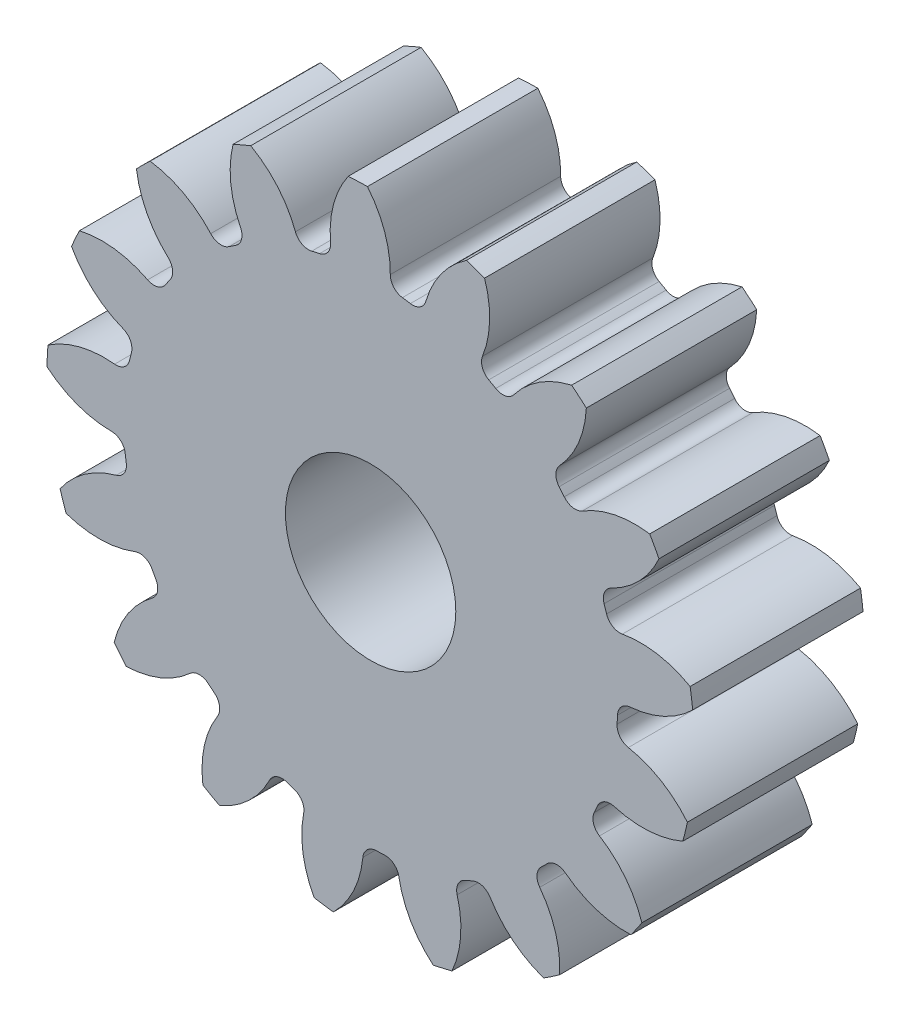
from build123d import *

# Parameters (mm, degrees)
SKETCH3_R         = 193.04
GEARBODY_DEPTH    = 101.6
TOOTHCUT_DEPTH    = 292.292710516
CIRPATTERN1_COUNT = 17
BOREDIA_R         = 50.8
BORE_DEPTH        = 12700


with BuildPart() as part:
    # Sketch3 → gearBody (new body)
    with BuildSketch(Plane.XY):
        Circle(SKETCH3_R)
    extrude(amount=GEARBODY_DEPTH)

    # Sketch2 → toothCut (cut, through all)
    with BuildSketch(Plane.XY):
        with BuildLine():
            ThreePointArc((146.968146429, -10.175771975), (147.114281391, -7.782712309), (147.221453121, -5.387591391))
            ThreePointArc((147.221453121, -5.387591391), (149.508396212, 0.025133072), (154.812998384, 2.552758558))
            ThreePointArc((154.812998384, 2.552758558), (175.587749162, 8.13415672), (193.04, 20.710373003))
            ThreePointArc((193.04, 20.710373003), (193.876672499, -10.256559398), (189.777358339, -40.962365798))
            ThreePointArc((189.777358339, -40.962365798), (173.74943399, -26.614964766), (153.679533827, -18.872782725))
            ThreePointArc((153.679533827, -18.872782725), (148.671229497, -15.79957877), (146.968146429, -10.175771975))
        make_face()
    toothcut = extrude(amount=TOOTHCUT_DEPTH, mode=Mode.SUBTRACT)

    # CirPattern1: toothCut ×17 about axis
    cirpattern1_axis = Axis((0, 0, 0), (0, 0, 1))
    for i in range(1, CIRPATTERN1_COUNT):
        add(toothcut.rotate(cirpattern1_axis, i * 360 / CIRPATTERN1_COUNT), mode=Mode.SUBTRACT)

    # boreDia → bore (cut, symmetric)
    with BuildSketch(Plane.XY):
        Circle(BOREDIA_R)
    extrude(amount=BORE_DEPTH, both=True, mode=Mode.SUBTRACT)


solid = part.part
